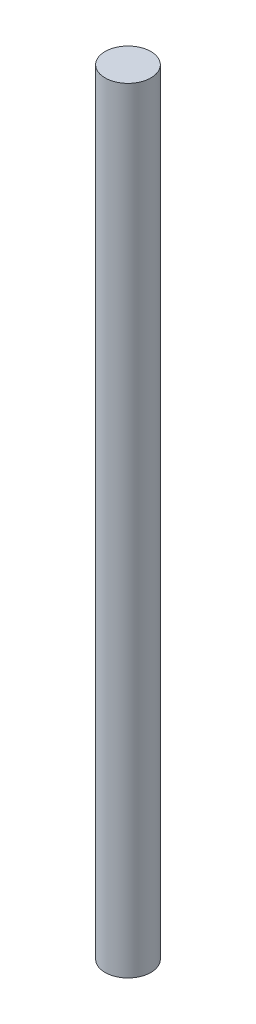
from build123d import *

# Parameters (mm, degrees)
SCHIZZO1_R                   = 1.95
ESTRUSIONE_ESTRUSIONE1_DEPTH = 66


with BuildPart() as part:
    # Schizzo1 → Estrusione-Estrusione1 (new body)
    with BuildSketch(Plane(origin=(0, 0, 0), x_dir=(1, 0, 0), z_dir=(0, 1, 0))):
        with Locations(Location((0, 0, 0), (0, 0, 270))):
            Circle(SCHIZZO1_R)
    extrude(amount=ESTRUSIONE_ESTRUSIONE1_DEPTH)


solid = part.part
